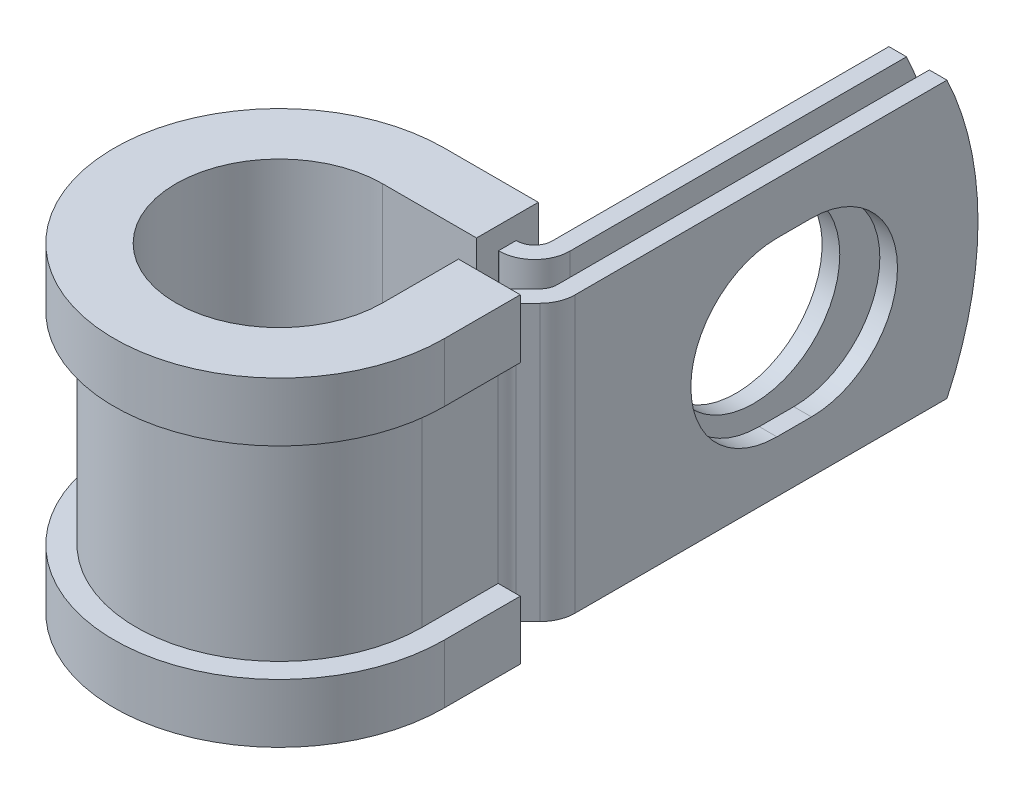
from build123d import *

# Parameters (mm, degrees)
EXTRUDE_THIN1_DEPTH = 9.525
SKETCH2_R           = 5.9436
CUT_EXTRUDE1_DEPTH  = 1.2192
CUT_EXTRUDE2_DEPTH  = 1.2192
CUT_EXTRUDE3_DEPTH  = 42.645211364


with BuildPart() as part:
    # Sketch1 → Extrude-Thin1 (new, symmetric)
    with BuildSketch(Plane(origin=(0, 0, 0), x_dir=(1, 0, 0), z_dir=(0, 1, 0))):
        with BuildLine():
            Line((10.5588698, 36.4998), (10.5588698, 8.6614))
            ThreePointArc((10.5588698, 8.6614), (10.466063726, 8.194832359), (10.201774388, 7.799295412))
            Line((10.201774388, 7.799295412), (9.375590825, 6.973111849))
            ThreePointArc((9.375590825, 6.973111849), (8.847012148, 6.182037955), (8.6614, 5.248902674))
            Line((8.6614, 5.248902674), (8.6614, 0))
            ThreePointArc((8.6614, 0), (-6.124534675, -6.124534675), (0, 8.6614))
            Line((0, 8.6614), (6.5456698, 8.6614))
            ThreePointArc((6.5456698, 8.6614), (8.269878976, 9.375590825), (8.9840698, 11.0998))
            Line((8.9840698, 11.0998), (8.9840698, 36.4998))
            Line((8.9840698, 36.4998), (7.7648698, 36.4998))
            Line((7.7648698, 36.4998), (7.7648698, 11.0998))
            ThreePointArc((7.7648698, 11.0998), (7.407774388, 10.237695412), (6.5456698, 9.8806))
            Line((6.5456698, 9.8806), (0, 9.8806))
            ThreePointArc((0, 9.8806), (-6.986639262, -6.986639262), (9.8806, 0))
            Line((9.8806, 0), (9.8806, 5.248902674))
            ThreePointArc((9.8806, 5.248902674), (9.973406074, 5.715470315), (10.237695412, 6.111007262))
            Line((10.237695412, 6.111007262), (11.063878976, 6.937190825))
            ThreePointArc((11.063878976, 6.937190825), (11.592457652, 7.728264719), (11.7780698, 8.6614))
            Line((11.7780698, 8.6614), (11.7780698, 36.4998))
            Line((11.7780698, 36.4998), (10.5588698, 36.4998))
        make_face()
    extrude(amount=EXTRUDE_THIN1_DEPTH, both=True)

    # Sketch2 → Cut-Extrude1 (cut)
    with BuildSketch(Plane.ZY.offset(-7.7648698)):
        with Locations((-23.7998, 0)):
            Circle(SKETCH2_R)
    extrude(amount=-CUT_EXTRUDE1_DEPTH, mode=Mode.SUBTRACT)

    # Sketch3 → Cut-Extrude2 (cut)
    with BuildSketch(Plane(origin=(11.7780698, 0, 0), x_dir=(0, 0, -1), z_dir=(1, 0, 0))):
        with BuildLine():
            Line((22.606, 5.9436), (24.9936, 5.9436))
            ThreePointArc((24.9936, 5.9436), (30.9372, 0), (24.9936, -5.9436))
            Line((24.9936, -5.9436), (22.606, -5.9436))
            ThreePointArc((22.606, -5.9436), (16.6624, 0), (22.606, 5.9436))
        make_face()
    extrude(amount=-CUT_EXTRUDE2_DEPTH, mode=Mode.SUBTRACT)

    # Sketch4 → Cut-Extrude3 (cut, through all)
    with BuildSketch(Plane.ZY.offset(-7.7648698)):
        with BuildLine():
            Line((-34.355263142, 9.525), (-36.4998, 9.525))
            Line((-36.4998, 9.525), (-36.4998, 0))
            ThreePointArc((-36.4998, 0), (-35.957038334, 4.881717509), (-34.355263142, 9.525))
        make_face()
        with BuildLine():
            ThreePointArc((-34.355263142, -9.525), (-35.957038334, -4.881717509), (-36.4998, 0))
            Line((-36.4998, 0), (-36.4998, -9.525))
            Line((-36.4998, -9.525), (-34.355263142, -9.525))
        make_face()
    extrude(amount=-CUT_EXTRUDE3_DEPTH, mode=Mode.SUBTRACT)

    # Sweep1: sweep along a path in Sketch6
    with BuildLine(Plane(origin=(0, 9.525, 0), x_dir=(1, 0, 0), z_dir=(0, 1, 0))) as sweep1_path:
        Line((7.1374, 5.248902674), (7.1374, 0))
        ThreePointArc((7.1374, 0), (-5.04690394, -5.04690394), (0, 7.1374))
        Line((0, 7.1374), (6.4948698, 7.1374))
    # Sketch5 → Sweep1 (sweep)
    with BuildSketch(Plane(origin=(0, 0, -5.248902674), x_dir=(-1, 0, 0), z_dir=(0, 0, -1))):
        Polygon((-9.8806, 9.525), (-8.6614, 9.525), (-8.6614, -9.525), (-9.8806, -9.525), (-9.8806, -6.985), (-11.4046, -6.985), (-11.4046, -11.049), (-7.1374, -11.049), (-7.1374, 11.049), (-11.4046, 11.049), (-11.4046, 6.985), (-9.8806, 6.985), align=None)
    sweep(path=sweep1_path.line)


solid = part.part
